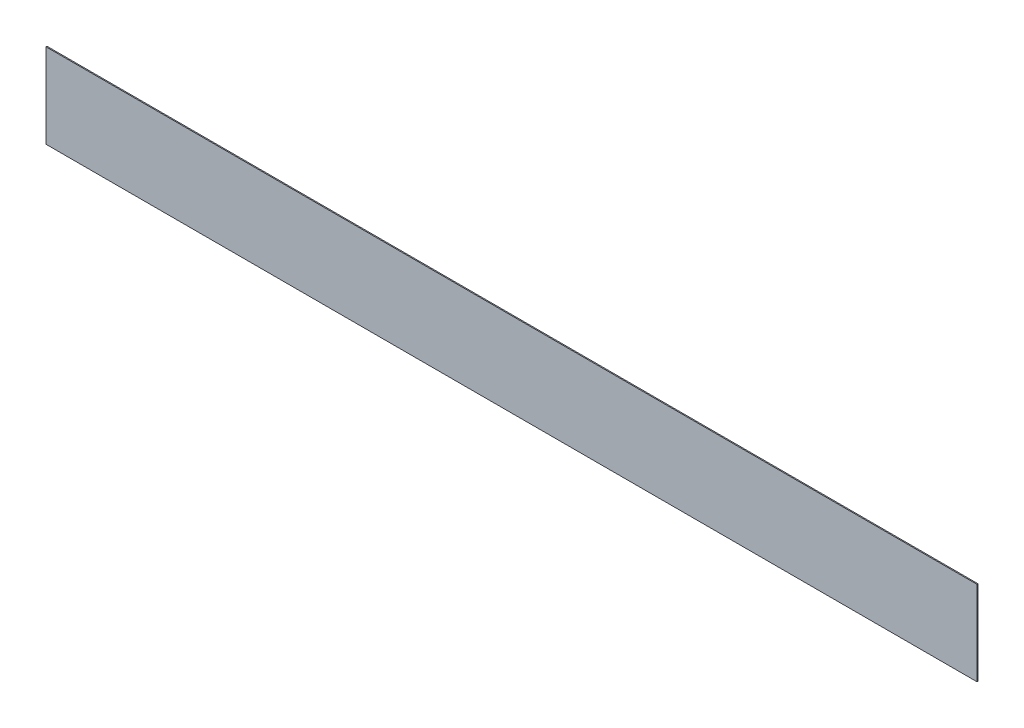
ISO-10303-21;
HEADER;
FILE_DESCRIPTION(('STEP AP214'),'2;1');
FILE_NAME('part.step','',(''),(''),'','','');
FILE_SCHEMA(('AUTOMOTIVE_DESIGN { 1 0 10303 214 1 1 1 1 }'));
ENDSEC;
DATA;
#1=APPLICATION_CONTEXT('core data for automotive mechanical design processes');
#2=APPLICATION_PROTOCOL_DEFINITION('international standard','automotive_design',2000,#1);
#3=PRODUCT_CONTEXT('',#1,'mechanical');
#4=PRODUCT('Part','Part','',(#3));
#5=PRODUCT_RELATED_PRODUCT_CATEGORY('part','',(#4));
#6=PRODUCT_DEFINITION_FORMATION('','',#4);
#7=PRODUCT_DEFINITION_CONTEXT('part definition',#1,'design');
#8=PRODUCT_DEFINITION('design','',#6,#7);
#9=PRODUCT_DEFINITION_SHAPE('','',#8);
#10=(LENGTH_UNIT() NAMED_UNIT(*) SI_UNIT(.MILLI.,.METRE.));
#11=(NAMED_UNIT(*) PLANE_ANGLE_UNIT() SI_UNIT($,.RADIAN.));
#12=(NAMED_UNIT(*) SI_UNIT($,.STERADIAN.) SOLID_ANGLE_UNIT());
#13=UNCERTAINTY_MEASURE_WITH_UNIT(LENGTH_MEASURE(1.E-05),#10,'distance_accuracy_value','');
#14=(GEOMETRIC_REPRESENTATION_CONTEXT(3) GLOBAL_UNCERTAINTY_ASSIGNED_CONTEXT((#13)) GLOBAL_UNIT_ASSIGNED_CONTEXT((#10,
#11,#12)) REPRESENTATION_CONTEXT('',''));
#15=CARTESIAN_POINT('',(0.,0.,0.));
#16=DIRECTION('',(0.,0.,1.));
#17=DIRECTION('',(1.,0.,0.));
#18=AXIS2_PLACEMENT_3D('',#15,#16,#17);
#19=CARTESIAN_POINT('',(-118.131068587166,38.8524363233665,2.));
#20=DIRECTION('',(1.,0.,0.));
#21=DIRECTION('',(0.,1.,0.));
#22=AXIS2_PLACEMENT_3D('',#19,#20,#21);
#23=PLANE('',#22);
#24=DIRECTION('',(0.,-1.,0.));
#25=VECTOR('',#24,1.);
#26=CARTESIAN_POINT('',(-118.131068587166,38.8524363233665,0.));
#27=LINE('',#26,#25);
#28=CARTESIAN_POINT('',(-118.131068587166,38.8524363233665,0.));
#29=VERTEX_POINT('',#28);
#30=CARTESIAN_POINT('',(-118.131068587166,-126.147563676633,0.));
#31=VERTEX_POINT('',#30);
#32=EDGE_CURVE('E95',#29,#31,#27,.T.);
#33=ORIENTED_EDGE('',*,*,#32,.T.);
#34=DIRECTION('',(0.,0.,-1.));
#35=VECTOR('',#34,1.);
#36=CARTESIAN_POINT('',(-118.131068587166,-126.147563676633,2.));
#37=LINE('',#36,#35);
#38=CARTESIAN_POINT('',(-118.131068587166,-126.147563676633,2.));
#39=VERTEX_POINT('',#38);
#40=EDGE_CURVE('E11',#39,#31,#37,.T.);
#41=ORIENTED_EDGE('',*,*,#40,.F.);
#42=DIRECTION('',(0.,-1.,0.));
#43=VECTOR('',#42,1.);
#44=CARTESIAN_POINT('',(-118.131068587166,38.8524363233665,2.));
#45=LINE('',#44,#43);
#46=CARTESIAN_POINT('',(-118.131068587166,38.8524363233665,2.));
#47=VERTEX_POINT('',#46);
#48=EDGE_CURVE('E83',#47,#39,#45,.T.);
#49=ORIENTED_EDGE('',*,*,#48,.F.);
#50=DIRECTION('',(0.,0.,-1.));
#51=VECTOR('',#50,1.);
#52=CARTESIAN_POINT('',(-118.131068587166,38.8524363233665,2.));
#53=LINE('',#52,#51);
#54=EDGE_CURVE('E91',#47,#29,#53,.T.);
#55=ORIENTED_EDGE('',*,*,#54,.T.);
#56=EDGE_LOOP('',(#33,#41,#49,#55));
#57=FACE_BOUND('',#56,.T.);
#58=ADVANCED_FACE('F32',(#57),#23,.F.);
#59=CARTESIAN_POINT('',(-118.131068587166,-126.147563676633,2.));
#60=DIRECTION('',(0.,1.,0.));
#61=DIRECTION('',(0.,0.,1.));
#62=AXIS2_PLACEMENT_3D('',#59,#60,#61);
#63=PLANE('',#62);
#64=DIRECTION('',(1.,0.,0.));
#65=VECTOR('',#64,1.);
#66=CARTESIAN_POINT('',(-118.131068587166,-126.147563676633,0.));
#67=LINE('',#66,#65);
#68=CARTESIAN_POINT('',(1701.86893141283,-126.147563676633,0.));
#69=VERTEX_POINT('',#68);
#70=EDGE_CURVE('E87',#31,#69,#67,.T.);
#71=ORIENTED_EDGE('',*,*,#70,.T.);
#72=DIRECTION('',(0.,0.,-1.));
#73=VECTOR('',#72,1.);
#74=CARTESIAN_POINT('',(1701.86893141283,-126.147563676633,2.));
#75=LINE('',#74,#73);
#76=CARTESIAN_POINT('',(1701.86893141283,-126.147563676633,2.));
#77=VERTEX_POINT('',#76);
#78=EDGE_CURVE('E40',#77,#69,#75,.T.);
#79=ORIENTED_EDGE('',*,*,#78,.F.);
#80=DIRECTION('',(1.,0.,0.));
#81=VECTOR('',#80,1.);
#82=CARTESIAN_POINT('',(-118.131068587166,-126.147563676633,2.));
#83=LINE('',#82,#81);
#84=EDGE_CURVE('E78',#39,#77,#83,.T.);
#85=ORIENTED_EDGE('',*,*,#84,.F.);
#86=ORIENTED_EDGE('',*,*,#40,.T.);
#87=EDGE_LOOP('',(#71,#79,#85,#86));
#88=FACE_BOUND('',#87,.T.);
#89=ADVANCED_FACE('F86',(#88),#63,.F.);
#90=CARTESIAN_POINT('',(1701.86893141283,38.8524363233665,2.));
#91=DIRECTION('',(-1.,0.,0.));
#92=DIRECTION('',(0.,0.,1.));
#93=AXIS2_PLACEMENT_3D('',#90,#91,#92);
#94=PLANE('',#93);
#95=DIRECTION('',(0.,1.,0.));
#96=VECTOR('',#95,1.);
#97=CARTESIAN_POINT('',(1701.86893141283,38.8524363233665,0.));
#98=LINE('',#97,#96);
#99=CARTESIAN_POINT('',(1701.86893141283,38.8524363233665,0.));
#100=VERTEX_POINT('',#99);
#101=EDGE_CURVE('E65',#69,#100,#98,.T.);
#102=ORIENTED_EDGE('',*,*,#101,.T.);
#103=DIRECTION('',(0.,0.,-1.));
#104=VECTOR('',#103,1.);
#105=CARTESIAN_POINT('',(1701.86893141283,38.8524363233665,2.));
#106=LINE('',#105,#104);
#107=CARTESIAN_POINT('',(1701.86893141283,38.8524363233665,2.));
#108=VERTEX_POINT('',#107);
#109=EDGE_CURVE('E88',#108,#100,#106,.T.);
#110=ORIENTED_EDGE('',*,*,#109,.F.);
#111=DIRECTION('',(0.,1.,0.));
#112=VECTOR('',#111,1.);
#113=CARTESIAN_POINT('',(1701.86893141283,38.8524363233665,2.));
#114=LINE('',#113,#112);
#115=EDGE_CURVE('E81',#77,#108,#114,.T.);
#116=ORIENTED_EDGE('',*,*,#115,.F.);
#117=ORIENTED_EDGE('',*,*,#78,.T.);
#118=EDGE_LOOP('',(#102,#110,#116,#117));
#119=FACE_BOUND('',#118,.T.);
#120=ADVANCED_FACE('F89',(#119),#94,.F.);
#121=CARTESIAN_POINT('',(-118.131068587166,38.8524363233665,2.));
#122=DIRECTION('',(0.,-1.,0.));
#123=DIRECTION('',(0.,0.,-1.));
#124=AXIS2_PLACEMENT_3D('',#121,#122,#123);
#125=PLANE('',#124);
#126=DIRECTION('',(-1.,0.,0.));
#127=VECTOR('',#126,1.);
#128=CARTESIAN_POINT('',(-118.131068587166,38.8524363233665,0.));
#129=LINE('',#128,#127);
#130=EDGE_CURVE('E71',#100,#29,#129,.T.);
#131=ORIENTED_EDGE('',*,*,#130,.T.);
#132=ORIENTED_EDGE('',*,*,#54,.F.);
#133=DIRECTION('',(-1.,0.,0.));
#134=VECTOR('',#133,1.);
#135=CARTESIAN_POINT('',(-118.131068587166,38.8524363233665,2.));
#136=LINE('',#135,#134);
#137=EDGE_CURVE('E48',#108,#47,#136,.T.);
#138=ORIENTED_EDGE('',*,*,#137,.F.);
#139=ORIENTED_EDGE('',*,*,#109,.T.);
#140=EDGE_LOOP('',(#131,#132,#138,#139));
#141=FACE_BOUND('',#140,.T.);
#142=ADVANCED_FACE('F102',(#141),#125,.F.);
#143=CARTESIAN_POINT('',(0.,0.,2.));
#144=DIRECTION('',(0.,0.,1.));
#145=DIRECTION('',(1.,0.,0.));
#146=AXIS2_PLACEMENT_3D('',#143,#144,#145);
#147=PLANE('',#146);
#148=ORIENTED_EDGE('',*,*,#48,.T.);
#149=ORIENTED_EDGE('',*,*,#84,.T.);
#150=ORIENTED_EDGE('',*,*,#115,.T.);
#151=ORIENTED_EDGE('',*,*,#137,.T.);
#152=EDGE_LOOP('',(#148,#149,#150,#151));
#153=FACE_BOUND('',#152,.T.);
#154=ADVANCED_FACE('F79',(#153),#147,.T.);
#155=CARTESIAN_POINT('',(0.,0.,0.));
#156=DIRECTION('',(0.,0.,1.));
#157=DIRECTION('',(1.,0.,0.));
#158=AXIS2_PLACEMENT_3D('',#155,#156,#157);
#159=PLANE('',#158);
#160=ORIENTED_EDGE('',*,*,#32,.F.);
#161=ORIENTED_EDGE('',*,*,#130,.F.);
#162=ORIENTED_EDGE('',*,*,#101,.F.);
#163=ORIENTED_EDGE('',*,*,#70,.F.);
#164=EDGE_LOOP('',(#160,#161,#162,#163));
#165=FACE_BOUND('',#164,.T.);
#166=ADVANCED_FACE('F105',(#165),#159,.F.);
#167=CLOSED_SHELL('',(#58,#89,#120,#142,#154,#166));
#168=MANIFOLD_SOLID_BREP('B2',#167);
#169=ADVANCED_BREP_SHAPE_REPRESENTATION('',(#18,#168),#14);
#170=SHAPE_DEFINITION_REPRESENTATION(#9,#169);
ENDSEC;
END-ISO-10303-21;
